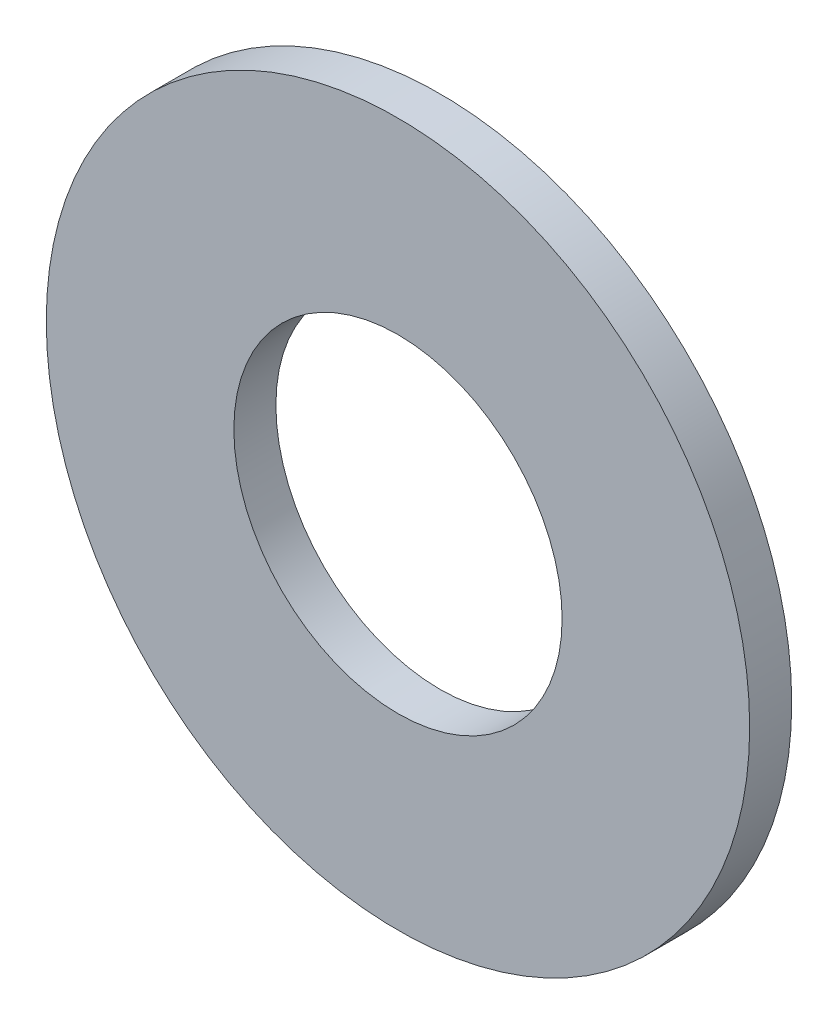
from build123d import *

# Parameters (mm, degrees)
SKETCH1_R          = 11.049
SKETCH1_R_2        = 5.1562
BASE_EXTRUDE_DEPTH = 1.3208


with BuildPart() as part:
    # Sketch1 → Base-Extrude (new body)
    with BuildSketch(Plane.XY):
        Circle(SKETCH1_R)
        Circle(SKETCH1_R_2, mode=Mode.SUBTRACT)
    extrude(amount=BASE_EXTRUDE_DEPTH)


solid = part.part
